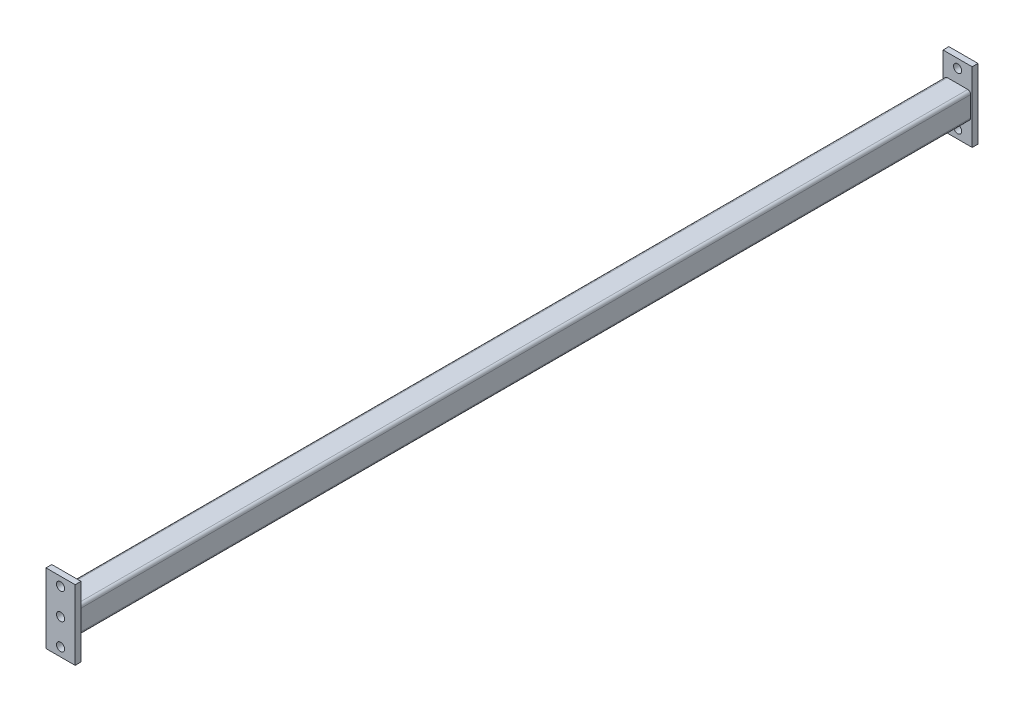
ISO-10303-21;
HEADER;
FILE_DESCRIPTION(('STEP AP214'),'2;1');
FILE_NAME('part.step','',(''),(''),'','','');
FILE_SCHEMA(('AUTOMOTIVE_DESIGN { 1 0 10303 214 1 1 1 1 }'));
ENDSEC;
DATA;
#1=APPLICATION_CONTEXT('core data for automotive mechanical design processes');
#2=APPLICATION_PROTOCOL_DEFINITION('international standard','automotive_design',2000,#1);
#3=PRODUCT_CONTEXT('',#1,'mechanical');
#4=PRODUCT('Part','Part','',(#3));
#5=PRODUCT_RELATED_PRODUCT_CATEGORY('part','',(#4));
#6=PRODUCT_DEFINITION_FORMATION('','',#4);
#7=PRODUCT_DEFINITION_CONTEXT('part definition',#1,'design');
#8=PRODUCT_DEFINITION('design','',#6,#7);
#9=PRODUCT_DEFINITION_SHAPE('','',#8);
#10=(LENGTH_UNIT() NAMED_UNIT(*) SI_UNIT(.MILLI.,.METRE.));
#11=(NAMED_UNIT(*) PLANE_ANGLE_UNIT() SI_UNIT($,.RADIAN.));
#12=(NAMED_UNIT(*) SI_UNIT($,.STERADIAN.) SOLID_ANGLE_UNIT());
#13=UNCERTAINTY_MEASURE_WITH_UNIT(LENGTH_MEASURE(1.E-05),#10,'distance_accuracy_value','');
#14=(GEOMETRIC_REPRESENTATION_CONTEXT(3) GLOBAL_UNCERTAINTY_ASSIGNED_CONTEXT((#13)) GLOBAL_UNIT_ASSIGNED_CONTEXT((#10,
#11,#12)) REPRESENTATION_CONTEXT('',''));
#15=CARTESIAN_POINT('',(0.,0.,0.));
#16=DIRECTION('',(0.,0.,1.));
#17=DIRECTION('',(1.,0.,0.));
#18=AXIS2_PLACEMENT_3D('',#15,#16,#17);
#19=CARTESIAN_POINT('',(-25.,-60.,10.));
#20=DIRECTION('',(0.,0.,1.));
#21=DIRECTION('',(1.,0.,0.));
#22=AXIS2_PLACEMENT_3D('',#19,#20,#21);
#23=PLANE('',#22);
#24=DIRECTION('',(0.,-1.,0.));
#25=VECTOR('',#24,1.);
#26=CARTESIAN_POINT('',(-25.,60.,10.));
#27=LINE('',#26,#25);
#28=CARTESIAN_POINT('',(-25.,60.,10.));
#29=VERTEX_POINT('',#28);
#30=CARTESIAN_POINT('',(-25.,-60.,10.));
#31=VERTEX_POINT('',#30);
#32=EDGE_CURVE('E334',#29,#31,#27,.T.);
#33=ORIENTED_EDGE('',*,*,#32,.T.);
#34=DIRECTION('',(1.,0.,0.));
#35=VECTOR('',#34,1.);
#36=CARTESIAN_POINT('',(-25.,-60.,10.));
#37=LINE('',#36,#35);
#38=CARTESIAN_POINT('',(25.,-60.,10.));
#39=VERTEX_POINT('',#38);
#40=EDGE_CURVE('E337',#31,#39,#37,.T.);
#41=ORIENTED_EDGE('',*,*,#40,.T.);
#42=DIRECTION('',(0.,1.,0.));
#43=VECTOR('',#42,1.);
#44=CARTESIAN_POINT('',(25.,60.,10.));
#45=LINE('',#44,#43);
#46=CARTESIAN_POINT('',(25.,60.,10.));
#47=VERTEX_POINT('',#46);
#48=EDGE_CURVE('E339',#39,#47,#45,.T.);
#49=ORIENTED_EDGE('',*,*,#48,.T.);
#50=DIRECTION('',(-1.,0.,0.));
#51=VECTOR('',#50,1.);
#52=CARTESIAN_POINT('',(-25.,60.,10.));
#53=LINE('',#52,#51);
#54=EDGE_CURVE('E341',#47,#29,#53,.T.);
#55=ORIENTED_EDGE('',*,*,#54,.T.);
#56=EDGE_LOOP('',(#33,#41,#49,#55));
#57=FACE_BOUND('',#56,.T.);
#58=CARTESIAN_POINT('',(0.,45.,10.));
#59=DIRECTION('',(0.,0.,1.));
#60=DIRECTION('',(1.,0.,0.));
#61=AXIS2_PLACEMENT_3D('',#58,#59,#60);
#62=CIRCLE('',#61,7.);
#63=CARTESIAN_POINT('',(7.,45.,10.));
#64=VERTEX_POINT('',#63);
#65=EDGE_CURVE('E322',#64,#64,#62,.T.);
#66=ORIENTED_EDGE('',*,*,#65,.F.);
#67=EDGE_LOOP('',(#66));
#68=FACE_BOUND('',#67,.T.);
#69=CARTESIAN_POINT('',(0.,-45.,10.));
#70=DIRECTION('',(0.,0.,1.));
#71=DIRECTION('',(1.,0.,0.));
#72=AXIS2_PLACEMENT_3D('',#69,#70,#71);
#73=CIRCLE('',#72,7.);
#74=CARTESIAN_POINT('',(7.,-45.,10.));
#75=VERTEX_POINT('',#74);
#76=EDGE_CURVE('E310',#75,#75,#73,.T.);
#77=ORIENTED_EDGE('',*,*,#76,.F.);
#78=EDGE_LOOP('',(#77));
#79=FACE_BOUND('',#78,.T.);
#80=DIRECTION('',(0.,-1.,0.));
#81=VECTOR('',#80,1.);
#82=CARTESIAN_POINT('',(-22.5,17.5,10.));
#83=LINE('',#82,#81);
#84=CARTESIAN_POINT('',(-22.5,17.5,10.));
#85=VERTEX_POINT('',#84);
#86=CARTESIAN_POINT('',(-22.5,-17.5,10.));
#87=VERTEX_POINT('',#86);
#88=EDGE_CURVE('E248',#85,#87,#83,.T.);
#89=ORIENTED_EDGE('',*,*,#88,.F.);
#90=CARTESIAN_POINT('',(-17.5,17.5,10.));
#91=DIRECTION('',(0.,0.,1.));
#92=DIRECTION('',(-1.,0.,0.));
#93=AXIS2_PLACEMENT_3D('',#90,#91,#92);
#94=CIRCLE('',#93,5.);
#95=CARTESIAN_POINT('',(-17.5,22.5,10.));
#96=VERTEX_POINT('',#95);
#97=EDGE_CURVE('E245',#96,#85,#94,.T.);
#98=ORIENTED_EDGE('',*,*,#97,.F.);
#99=DIRECTION('',(-1.,0.,0.));
#100=VECTOR('',#99,1.);
#101=CARTESIAN_POINT('',(-17.5,22.5,10.));
#102=LINE('',#101,#100);
#103=CARTESIAN_POINT('',(17.5,22.5,10.));
#104=VERTEX_POINT('',#103);
#105=EDGE_CURVE('E260',#104,#96,#102,.T.);
#106=ORIENTED_EDGE('',*,*,#105,.F.);
#107=CARTESIAN_POINT('',(17.5,17.5,10.));
#108=DIRECTION('',(0.,0.,1.));
#109=DIRECTION('',(-1.,0.,0.));
#110=AXIS2_PLACEMENT_3D('',#107,#108,#109);
#111=CIRCLE('',#110,5.);
#112=CARTESIAN_POINT('',(22.5,17.5,10.));
#113=VERTEX_POINT('',#112);
#114=EDGE_CURVE('E258',#113,#104,#111,.T.);
#115=ORIENTED_EDGE('',*,*,#114,.F.);
#116=DIRECTION('',(0.,1.,0.));
#117=VECTOR('',#116,1.);
#118=CARTESIAN_POINT('',(22.5,17.5,10.));
#119=LINE('',#118,#117);
#120=CARTESIAN_POINT('',(22.5,-17.5,10.));
#121=VERTEX_POINT('',#120);
#122=EDGE_CURVE('E256',#121,#113,#119,.T.);
#123=ORIENTED_EDGE('',*,*,#122,.F.);
#124=CARTESIAN_POINT('',(17.5,-17.5,10.));
#125=DIRECTION('',(0.,0.,1.));
#126=DIRECTION('',(-1.,0.,0.));
#127=AXIS2_PLACEMENT_3D('',#124,#125,#126);
#128=CIRCLE('',#127,5.);
#129=CARTESIAN_POINT('',(17.5,-22.5,10.));
#130=VERTEX_POINT('',#129);
#131=EDGE_CURVE('E254',#130,#121,#128,.T.);
#132=ORIENTED_EDGE('',*,*,#131,.F.);
#133=DIRECTION('',(1.,0.,0.));
#134=VECTOR('',#133,1.);
#135=CARTESIAN_POINT('',(-17.5,-22.5,10.));
#136=LINE('',#135,#134);
#137=CARTESIAN_POINT('',(-17.5,-22.5,10.));
#138=VERTEX_POINT('',#137);
#139=EDGE_CURVE('E252',#138,#130,#136,.T.);
#140=ORIENTED_EDGE('',*,*,#139,.F.);
#141=CARTESIAN_POINT('',(-17.5,-17.5,10.));
#142=DIRECTION('',(0.,0.,1.));
#143=DIRECTION('',(-1.,0.,0.));
#144=AXIS2_PLACEMENT_3D('',#141,#142,#143);
#145=CIRCLE('',#144,5.);
#146=EDGE_CURVE('E250',#87,#138,#145,.T.);
#147=ORIENTED_EDGE('',*,*,#146,.F.);
#148=EDGE_LOOP('',(#89,#98,#106,#115,#123,#132,#140,#147));
#149=FACE_BOUND('',#148,.T.);
#150=ADVANCED_FACE('F30',(#57,#68,#79,#149),#23,.T.);
#151=DIRECTION('',(0.,-1.,0.));
#152=VECTOR('',#151,1.);
#153=CARTESIAN_POINT('',(-19.5,19.5,10.));
#154=LINE('',#153,#152);
#155=CARTESIAN_POINT('',(-19.5,19.5,10.));
#156=VERTEX_POINT('',#155);
#157=CARTESIAN_POINT('',(-19.5,-19.5,10.));
#158=VERTEX_POINT('',#157);
#159=EDGE_CURVE('E53',#156,#158,#154,.T.);
#160=ORIENTED_EDGE('',*,*,#159,.T.);
#161=DIRECTION('',(1.,0.,0.));
#162=VECTOR('',#161,1.);
#163=CARTESIAN_POINT('',(-19.5,-19.5,10.));
#164=LINE('',#163,#162);
#165=CARTESIAN_POINT('',(19.5,-19.5,10.));
#166=VERTEX_POINT('',#165);
#167=EDGE_CURVE('E215',#158,#166,#164,.T.);
#168=ORIENTED_EDGE('',*,*,#167,.T.);
#169=DIRECTION('',(0.,1.,0.));
#170=VECTOR('',#169,1.);
#171=CARTESIAN_POINT('',(19.5,19.5,10.));
#172=LINE('',#171,#170);
#173=CARTESIAN_POINT('',(19.5,19.5,10.));
#174=VERTEX_POINT('',#173);
#175=EDGE_CURVE('E217',#166,#174,#172,.T.);
#176=ORIENTED_EDGE('',*,*,#175,.T.);
#177=DIRECTION('',(-1.,0.,0.));
#178=VECTOR('',#177,1.);
#179=CARTESIAN_POINT('',(-19.5,19.5,10.));
#180=LINE('',#179,#178);
#181=EDGE_CURVE('E219',#174,#156,#180,.T.);
#182=ORIENTED_EDGE('',*,*,#181,.T.);
#183=EDGE_LOOP('',(#160,#168,#176,#182));
#184=FACE_BOUND('',#183,.T.);
#185=CARTESIAN_POINT('',(0.,0.,10.));
#186=DIRECTION('',(0.,0.,1.));
#187=DIRECTION('',(1.,0.,0.));
#188=AXIS2_PLACEMENT_3D('',#185,#186,#187);
#189=CIRCLE('',#188,7.);
#190=CARTESIAN_POINT('',(7.,0.,10.));
#191=VERTEX_POINT('',#190);
#192=EDGE_CURVE('E316',#191,#191,#189,.T.);
#193=ORIENTED_EDGE('',*,*,#192,.F.);
#194=EDGE_LOOP('',(#193));
#195=FACE_BOUND('',#194,.T.);
#196=ADVANCED_FACE('F378',(#184,#195),#23,.T.);
#197=CARTESIAN_POINT('',(-25.,-60.,0.));
#198=DIRECTION('',(0.,0.,1.));
#199=DIRECTION('',(1.,0.,0.));
#200=AXIS2_PLACEMENT_3D('',#197,#198,#199);
#201=PLANE('',#200);
#202=CARTESIAN_POINT('',(0.,0.,0.));
#203=DIRECTION('',(0.,0.,1.));
#204=DIRECTION('',(1.,0.,0.));
#205=AXIS2_PLACEMENT_3D('',#202,#203,#204);
#206=CIRCLE('',#205,7.);
#207=CARTESIAN_POINT('',(7.,0.,0.));
#208=VERTEX_POINT('',#207);
#209=EDGE_CURVE('E313',#208,#208,#206,.T.);
#210=ORIENTED_EDGE('',*,*,#209,.T.);
#211=EDGE_LOOP('',(#210));
#212=FACE_BOUND('',#211,.T.);
#213=DIRECTION('',(0.,-1.,0.));
#214=VECTOR('',#213,1.);
#215=CARTESIAN_POINT('',(-25.,60.,0.));
#216=LINE('',#215,#214);
#217=CARTESIAN_POINT('',(-25.,60.,0.));
#218=VERTEX_POINT('',#217);
#219=CARTESIAN_POINT('',(-25.,-60.,0.));
#220=VERTEX_POINT('',#219);
#221=EDGE_CURVE('E325',#218,#220,#216,.T.);
#222=ORIENTED_EDGE('',*,*,#221,.F.);
#223=DIRECTION('',(-1.,0.,0.));
#224=VECTOR('',#223,1.);
#225=CARTESIAN_POINT('',(-25.,60.,0.));
#226=LINE('',#225,#224);
#227=CARTESIAN_POINT('',(25.,60.,0.));
#228=VERTEX_POINT('',#227);
#229=EDGE_CURVE('E332',#228,#218,#226,.T.);
#230=ORIENTED_EDGE('',*,*,#229,.F.);
#231=DIRECTION('',(0.,1.,0.));
#232=VECTOR('',#231,1.);
#233=CARTESIAN_POINT('',(25.,60.,0.));
#234=LINE('',#233,#232);
#235=CARTESIAN_POINT('',(25.,-60.,0.));
#236=VERTEX_POINT('',#235);
#237=EDGE_CURVE('E330',#236,#228,#234,.T.);
#238=ORIENTED_EDGE('',*,*,#237,.F.);
#239=DIRECTION('',(1.,0.,0.));
#240=VECTOR('',#239,1.);
#241=CARTESIAN_POINT('',(-25.,-60.,0.));
#242=LINE('',#241,#240);
#243=EDGE_CURVE('E328',#220,#236,#242,.T.);
#244=ORIENTED_EDGE('',*,*,#243,.F.);
#245=EDGE_LOOP('',(#222,#230,#238,#244));
#246=FACE_BOUND('',#245,.T.);
#247=CARTESIAN_POINT('',(0.,45.,0.));
#248=DIRECTION('',(0.,0.,1.));
#249=DIRECTION('',(1.,0.,0.));
#250=AXIS2_PLACEMENT_3D('',#247,#248,#249);
#251=CIRCLE('',#250,7.);
#252=CARTESIAN_POINT('',(7.,45.,0.));
#253=VERTEX_POINT('',#252);
#254=EDGE_CURVE('E319',#253,#253,#251,.T.);
#255=ORIENTED_EDGE('',*,*,#254,.T.);
#256=EDGE_LOOP('',(#255));
#257=FACE_BOUND('',#256,.T.);
#258=CARTESIAN_POINT('',(0.,-45.,0.));
#259=DIRECTION('',(0.,0.,1.));
#260=DIRECTION('',(1.,0.,0.));
#261=AXIS2_PLACEMENT_3D('',#258,#259,#260);
#262=CIRCLE('',#261,7.);
#263=CARTESIAN_POINT('',(7.,-45.,0.));
#264=VERTEX_POINT('',#263);
#265=EDGE_CURVE('E307',#264,#264,#262,.T.);
#266=ORIENTED_EDGE('',*,*,#265,.T.);
#267=EDGE_LOOP('',(#266));
#268=FACE_BOUND('',#267,.T.);
#269=ADVANCED_FACE('F359',(#212,#246,#257,#268),#201,.F.);
#270=CARTESIAN_POINT('',(-25.,60.,10.));
#271=DIRECTION('',(1.,0.,0.));
#272=DIRECTION('',(0.,1.,0.));
#273=AXIS2_PLACEMENT_3D('',#270,#271,#272);
#274=PLANE('',#273);
#275=ORIENTED_EDGE('',*,*,#221,.T.);
#276=DIRECTION('',(0.,0.,-1.));
#277=VECTOR('',#276,1.);
#278=CARTESIAN_POINT('',(-25.,-60.,10.));
#279=LINE('',#278,#277);
#280=EDGE_CURVE('E11',#31,#220,#279,.T.);
#281=ORIENTED_EDGE('',*,*,#280,.F.);
#282=ORIENTED_EDGE('',*,*,#32,.F.);
#283=DIRECTION('',(0.,0.,-1.));
#284=VECTOR('',#283,1.);
#285=CARTESIAN_POINT('',(-25.,60.,10.));
#286=LINE('',#285,#284);
#287=EDGE_CURVE('E343',#29,#218,#286,.T.);
#288=ORIENTED_EDGE('',*,*,#287,.T.);
#289=EDGE_LOOP('',(#275,#281,#282,#288));
#290=FACE_BOUND('',#289,.T.);
#291=ADVANCED_FACE('F32',(#290),#274,.F.);
#292=CARTESIAN_POINT('',(-25.,-60.,10.));
#293=DIRECTION('',(0.,1.,0.));
#294=DIRECTION('',(0.,0.,1.));
#295=AXIS2_PLACEMENT_3D('',#292,#293,#294);
#296=PLANE('',#295);
#297=ORIENTED_EDGE('',*,*,#243,.T.);
#298=DIRECTION('',(0.,0.,-1.));
#299=VECTOR('',#298,1.);
#300=CARTESIAN_POINT('',(25.,-60.,10.));
#301=LINE('',#300,#299);
#302=EDGE_CURVE('E38',#39,#236,#301,.T.);
#303=ORIENTED_EDGE('',*,*,#302,.F.);
#304=ORIENTED_EDGE('',*,*,#40,.F.);
#305=ORIENTED_EDGE('',*,*,#280,.T.);
#306=EDGE_LOOP('',(#297,#303,#304,#305));
#307=FACE_BOUND('',#306,.T.);
#308=ADVANCED_FACE('F370',(#307),#296,.F.);
#309=CARTESIAN_POINT('',(25.,60.,10.));
#310=DIRECTION('',(-1.,0.,0.));
#311=DIRECTION('',(0.,-1.,0.));
#312=AXIS2_PLACEMENT_3D('',#309,#310,#311);
#313=PLANE('',#312);
#314=ORIENTED_EDGE('',*,*,#237,.T.);
#315=DIRECTION('',(0.,0.,-1.));
#316=VECTOR('',#315,1.);
#317=CARTESIAN_POINT('',(25.,60.,10.));
#318=LINE('',#317,#316);
#319=EDGE_CURVE('E346',#47,#228,#318,.T.);
#320=ORIENTED_EDGE('',*,*,#319,.F.);
#321=ORIENTED_EDGE('',*,*,#48,.F.);
#322=ORIENTED_EDGE('',*,*,#302,.T.);
#323=EDGE_LOOP('',(#314,#320,#321,#322));
#324=FACE_BOUND('',#323,.T.);
#325=ADVANCED_FACE('F353',(#324),#313,.F.);
#326=CARTESIAN_POINT('',(-25.,60.,10.));
#327=DIRECTION('',(0.,-1.,0.));
#328=DIRECTION('',(0.,0.,-1.));
#329=AXIS2_PLACEMENT_3D('',#326,#327,#328);
#330=PLANE('',#329);
#331=ORIENTED_EDGE('',*,*,#229,.T.);
#332=ORIENTED_EDGE('',*,*,#287,.F.);
#333=ORIENTED_EDGE('',*,*,#54,.F.);
#334=ORIENTED_EDGE('',*,*,#319,.T.);
#335=EDGE_LOOP('',(#331,#332,#333,#334));
#336=FACE_BOUND('',#335,.T.);
#337=ADVANCED_FACE('F363',(#336),#330,.F.);
#338=CARTESIAN_POINT('',(0.,45.,10.));
#339=DIRECTION('',(0.,0.,-1.));
#340=DIRECTION('',(-1.,0.,0.));
#341=AXIS2_PLACEMENT_3D('',#338,#339,#340);
#342=CYLINDRICAL_SURFACE('',#341,7.);
#343=ORIENTED_EDGE('',*,*,#65,.T.);
#344=EDGE_LOOP('',(#343));
#345=FACE_BOUND('',#344,.T.);
#346=ORIENTED_EDGE('',*,*,#254,.F.);
#347=EDGE_LOOP('',(#346));
#348=FACE_BOUND('',#347,.T.);
#349=ADVANCED_FACE('F387',(#345,#348),#342,.F.);
#350=CARTESIAN_POINT('',(0.,0.,10.));
#351=DIRECTION('',(0.,0.,-1.));
#352=DIRECTION('',(-1.,0.,0.));
#353=AXIS2_PLACEMENT_3D('',#350,#351,#352);
#354=CYLINDRICAL_SURFACE('',#353,7.);
#355=ORIENTED_EDGE('',*,*,#192,.T.);
#356=EDGE_LOOP('',(#355));
#357=FACE_BOUND('',#356,.T.);
#358=ORIENTED_EDGE('',*,*,#209,.F.);
#359=EDGE_LOOP('',(#358));
#360=FACE_BOUND('',#359,.T.);
#361=ADVANCED_FACE('F391',(#357,#360),#354,.F.);
#362=CARTESIAN_POINT('',(0.,-45.,10.));
#363=DIRECTION('',(0.,0.,-1.));
#364=DIRECTION('',(-1.,0.,0.));
#365=AXIS2_PLACEMENT_3D('',#362,#363,#364);
#366=CYLINDRICAL_SURFACE('',#365,7.);
#367=ORIENTED_EDGE('',*,*,#76,.T.);
#368=EDGE_LOOP('',(#367));
#369=FACE_BOUND('',#368,.T.);
#370=ORIENTED_EDGE('',*,*,#265,.F.);
#371=EDGE_LOOP('',(#370));
#372=FACE_BOUND('',#371,.T.);
#373=ADVANCED_FACE('F396',(#369,#372),#366,.F.);
#374=CARTESIAN_POINT('',(-17.5,17.5,1540.));
#375=DIRECTION('',(0.,0.,-1.));
#376=DIRECTION('',(-1.,0.,0.));
#377=AXIS2_PLACEMENT_3D('',#374,#375,#376);
#378=CYLINDRICAL_SURFACE('',#377,5.);
#379=ORIENTED_EDGE('',*,*,#97,.T.);
#380=DIRECTION('',(0.,0.,-1.));
#381=VECTOR('',#380,1.);
#382=CARTESIAN_POINT('',(-22.5,17.5,1540.));
#383=LINE('',#382,#381);
#384=CARTESIAN_POINT('',(-22.5,17.5,1540.));
#385=VERTEX_POINT('',#384);
#386=EDGE_CURVE('E305',#385,#85,#383,.T.);
#387=ORIENTED_EDGE('',*,*,#386,.F.);
#388=CARTESIAN_POINT('',(-17.5,17.5,1540.));
#389=DIRECTION('',(0.,0.,1.));
#390=DIRECTION('',(-1.,0.,0.));
#391=AXIS2_PLACEMENT_3D('',#388,#389,#390);
#392=CIRCLE('',#391,5.);
#393=CARTESIAN_POINT('',(-17.5,22.5,1540.));
#394=VERTEX_POINT('',#393);
#395=EDGE_CURVE('E262',#394,#385,#392,.T.);
#396=ORIENTED_EDGE('',*,*,#395,.F.);
#397=DIRECTION('',(0.,0.,-1.));
#398=VECTOR('',#397,1.);
#399=CARTESIAN_POINT('',(-17.5,22.5,1540.));
#400=LINE('',#399,#398);
#401=EDGE_CURVE('E286',#394,#96,#400,.T.);
#402=ORIENTED_EDGE('',*,*,#401,.T.);
#403=EDGE_LOOP('',(#379,#387,#396,#402));
#404=FACE_BOUND('',#403,.T.);
#405=ADVANCED_FACE('F403',(#404),#378,.T.);
#406=CARTESIAN_POINT('',(-22.5,17.5,1540.));
#407=DIRECTION('',(1.,0.,0.));
#408=DIRECTION('',(0.,1.,0.));
#409=AXIS2_PLACEMENT_3D('',#406,#407,#408);
#410=PLANE('',#409);
#411=ORIENTED_EDGE('',*,*,#88,.T.);
#412=DIRECTION('',(0.,0.,-1.));
#413=VECTOR('',#412,1.);
#414=CARTESIAN_POINT('',(-22.5,-17.5,1540.));
#415=LINE('',#414,#413);
#416=CARTESIAN_POINT('',(-22.5,-17.5,1540.));
#417=VERTEX_POINT('',#416);
#418=EDGE_CURVE('E302',#417,#87,#415,.T.);
#419=ORIENTED_EDGE('',*,*,#418,.F.);
#420=DIRECTION('',(0.,-1.,0.));
#421=VECTOR('',#420,1.);
#422=CARTESIAN_POINT('',(-22.5,17.5,1540.));
#423=LINE('',#422,#421);
#424=EDGE_CURVE('E265',#385,#417,#423,.T.);
#425=ORIENTED_EDGE('',*,*,#424,.F.);
#426=ORIENTED_EDGE('',*,*,#386,.T.);
#427=EDGE_LOOP('',(#411,#419,#425,#426));
#428=FACE_BOUND('',#427,.T.);
#429=ADVANCED_FACE('F407',(#428),#410,.F.);
#430=CARTESIAN_POINT('',(-17.5,-17.5,1540.));
#431=DIRECTION('',(0.,0.,-1.));
#432=DIRECTION('',(-1.,0.,0.));
#433=AXIS2_PLACEMENT_3D('',#430,#431,#432);
#434=CYLINDRICAL_SURFACE('',#433,5.);
#435=ORIENTED_EDGE('',*,*,#146,.T.);
#436=DIRECTION('',(0.,0.,-1.));
#437=VECTOR('',#436,1.);
#438=CARTESIAN_POINT('',(-17.5,-22.5,1540.));
#439=LINE('',#438,#437);
#440=CARTESIAN_POINT('',(-17.5,-22.5,1540.));
#441=VERTEX_POINT('',#440);
#442=EDGE_CURVE('E299',#441,#138,#439,.T.);
#443=ORIENTED_EDGE('',*,*,#442,.F.);
#444=CARTESIAN_POINT('',(-17.5,-17.5,1540.));
#445=DIRECTION('',(0.,0.,1.));
#446=DIRECTION('',(-1.,0.,0.));
#447=AXIS2_PLACEMENT_3D('',#444,#445,#446);
#448=CIRCLE('',#447,5.);
#449=EDGE_CURVE('E268',#417,#441,#448,.T.);
#450=ORIENTED_EDGE('',*,*,#449,.F.);
#451=ORIENTED_EDGE('',*,*,#418,.T.);
#452=EDGE_LOOP('',(#435,#443,#450,#451));
#453=FACE_BOUND('',#452,.T.);
#454=ADVANCED_FACE('F411',(#453),#434,.T.);
#455=CARTESIAN_POINT('',(-17.5,-22.5,1540.));
#456=DIRECTION('',(0.,1.,0.));
#457=DIRECTION('',(0.,0.,1.));
#458=AXIS2_PLACEMENT_3D('',#455,#456,#457);
#459=PLANE('',#458);
#460=ORIENTED_EDGE('',*,*,#139,.T.);
#461=DIRECTION('',(0.,0.,-1.));
#462=VECTOR('',#461,1.);
#463=CARTESIAN_POINT('',(17.5,-22.5,1540.));
#464=LINE('',#463,#462);
#465=CARTESIAN_POINT('',(17.5,-22.5,1540.));
#466=VERTEX_POINT('',#465);
#467=EDGE_CURVE('E296',#466,#130,#464,.T.);
#468=ORIENTED_EDGE('',*,*,#467,.F.);
#469=DIRECTION('',(1.,0.,0.));
#470=VECTOR('',#469,1.);
#471=CARTESIAN_POINT('',(-17.5,-22.5,1540.));
#472=LINE('',#471,#470);
#473=EDGE_CURVE('E271',#441,#466,#472,.T.);
#474=ORIENTED_EDGE('',*,*,#473,.F.);
#475=ORIENTED_EDGE('',*,*,#442,.T.);
#476=EDGE_LOOP('',(#460,#468,#474,#475));
#477=FACE_BOUND('',#476,.T.);
#478=ADVANCED_FACE('F415',(#477),#459,.F.);
#479=CARTESIAN_POINT('',(17.5,-17.5,1540.));
#480=DIRECTION('',(0.,0.,-1.));
#481=DIRECTION('',(-1.,0.,0.));
#482=AXIS2_PLACEMENT_3D('',#479,#480,#481);
#483=CYLINDRICAL_SURFACE('',#482,5.);
#484=ORIENTED_EDGE('',*,*,#131,.T.);
#485=DIRECTION('',(0.,0.,-1.));
#486=VECTOR('',#485,1.);
#487=CARTESIAN_POINT('',(22.5,-17.5,1540.));
#488=LINE('',#487,#486);
#489=CARTESIAN_POINT('',(22.5,-17.5,1540.));
#490=VERTEX_POINT('',#489);
#491=EDGE_CURVE('E293',#490,#121,#488,.T.);
#492=ORIENTED_EDGE('',*,*,#491,.F.);
#493=CARTESIAN_POINT('',(17.5,-17.5,1540.));
#494=DIRECTION('',(0.,0.,1.));
#495=DIRECTION('',(-1.,0.,0.));
#496=AXIS2_PLACEMENT_3D('',#493,#494,#495);
#497=CIRCLE('',#496,5.);
#498=EDGE_CURVE('E274',#466,#490,#497,.T.);
#499=ORIENTED_EDGE('',*,*,#498,.F.);
#500=ORIENTED_EDGE('',*,*,#467,.T.);
#501=EDGE_LOOP('',(#484,#492,#499,#500));
#502=FACE_BOUND('',#501,.T.);
#503=ADVANCED_FACE('F419',(#502),#483,.T.);
#504=CARTESIAN_POINT('',(22.5,17.5,1540.));
#505=DIRECTION('',(-1.,0.,0.));
#506=DIRECTION('',(0.,-1.,0.));
#507=AXIS2_PLACEMENT_3D('',#504,#505,#506);
#508=PLANE('',#507);
#509=ORIENTED_EDGE('',*,*,#122,.T.);
#510=DIRECTION('',(0.,0.,-1.));
#511=VECTOR('',#510,1.);
#512=CARTESIAN_POINT('',(22.5,17.5,1540.));
#513=LINE('',#512,#511);
#514=CARTESIAN_POINT('',(22.5,17.5,1540.));
#515=VERTEX_POINT('',#514);
#516=EDGE_CURVE('E290',#515,#113,#513,.T.);
#517=ORIENTED_EDGE('',*,*,#516,.F.);
#518=DIRECTION('',(0.,1.,0.));
#519=VECTOR('',#518,1.);
#520=CARTESIAN_POINT('',(22.5,17.5,1540.));
#521=LINE('',#520,#519);
#522=EDGE_CURVE('E277',#490,#515,#521,.T.);
#523=ORIENTED_EDGE('',*,*,#522,.F.);
#524=ORIENTED_EDGE('',*,*,#491,.T.);
#525=EDGE_LOOP('',(#509,#517,#523,#524));
#526=FACE_BOUND('',#525,.T.);
#527=ADVANCED_FACE('F423',(#526),#508,.F.);
#528=CARTESIAN_POINT('',(17.5,17.5,1540.));
#529=DIRECTION('',(0.,0.,-1.));
#530=DIRECTION('',(-1.,0.,0.));
#531=AXIS2_PLACEMENT_3D('',#528,#529,#530);
#532=CYLINDRICAL_SURFACE('',#531,5.);
#533=ORIENTED_EDGE('',*,*,#114,.T.);
#534=DIRECTION('',(0.,0.,-1.));
#535=VECTOR('',#534,1.);
#536=CARTESIAN_POINT('',(17.5,22.5,1540.));
#537=LINE('',#536,#535);
#538=CARTESIAN_POINT('',(17.5,22.5,1540.));
#539=VERTEX_POINT('',#538);
#540=EDGE_CURVE('E45',#539,#104,#537,.T.);
#541=ORIENTED_EDGE('',*,*,#540,.F.);
#542=CARTESIAN_POINT('',(17.5,17.5,1540.));
#543=DIRECTION('',(0.,0.,1.));
#544=DIRECTION('',(-1.,0.,0.));
#545=AXIS2_PLACEMENT_3D('',#542,#543,#544);
#546=CIRCLE('',#545,5.);
#547=EDGE_CURVE('E280',#515,#539,#546,.T.);
#548=ORIENTED_EDGE('',*,*,#547,.F.);
#549=ORIENTED_EDGE('',*,*,#516,.T.);
#550=EDGE_LOOP('',(#533,#541,#548,#549));
#551=FACE_BOUND('',#550,.T.);
#552=ADVANCED_FACE('F427',(#551),#532,.T.);
#553=CARTESIAN_POINT('',(-17.5,22.5,1540.));
#554=DIRECTION('',(0.,-1.,0.));
#555=DIRECTION('',(0.,0.,-1.));
#556=AXIS2_PLACEMENT_3D('',#553,#554,#555);
#557=PLANE('',#556);
#558=ORIENTED_EDGE('',*,*,#105,.T.);
#559=ORIENTED_EDGE('',*,*,#401,.F.);
#560=DIRECTION('',(-1.,0.,0.));
#561=VECTOR('',#560,1.);
#562=CARTESIAN_POINT('',(-17.5,22.5,1540.));
#563=LINE('',#562,#561);
#564=EDGE_CURVE('E283',#539,#394,#563,.T.);
#565=ORIENTED_EDGE('',*,*,#564,.F.);
#566=ORIENTED_EDGE('',*,*,#540,.T.);
#567=EDGE_LOOP('',(#558,#559,#565,#566));
#568=FACE_BOUND('',#567,.T.);
#569=ADVANCED_FACE('F431',(#568),#557,.F.);
#570=CARTESIAN_POINT('',(-19.5,19.5,1540.));
#571=DIRECTION('',(1.,0.,0.));
#572=DIRECTION('',(0.,1.,0.));
#573=AXIS2_PLACEMENT_3D('',#570,#571,#572);
#574=PLANE('',#573);
#575=ORIENTED_EDGE('',*,*,#159,.F.);
#576=DIRECTION('',(0.,0.,-1.));
#577=VECTOR('',#576,1.);
#578=CARTESIAN_POINT('',(-19.5,19.5,1540.));
#579=LINE('',#578,#577);
#580=CARTESIAN_POINT('',(-19.5,19.5,1540.));
#581=VERTEX_POINT('',#580);
#582=EDGE_CURVE('E233',#581,#156,#579,.T.);
#583=ORIENTED_EDGE('',*,*,#582,.F.);
#584=DIRECTION('',(0.,-1.,0.));
#585=VECTOR('',#584,1.);
#586=CARTESIAN_POINT('',(-19.5,19.5,1540.));
#587=LINE('',#586,#585);
#588=CARTESIAN_POINT('',(-19.5,-19.5,1540.));
#589=VERTEX_POINT('',#588);
#590=EDGE_CURVE('E221',#581,#589,#587,.T.);
#591=ORIENTED_EDGE('',*,*,#590,.T.);
#592=DIRECTION('',(0.,0.,-1.));
#593=VECTOR('',#592,1.);
#594=CARTESIAN_POINT('',(-19.5,-19.5,1540.));
#595=LINE('',#594,#593);
#596=EDGE_CURVE('E242',#589,#158,#595,.T.);
#597=ORIENTED_EDGE('',*,*,#596,.T.);
#598=EDGE_LOOP('',(#575,#583,#591,#597));
#599=FACE_BOUND('',#598,.T.);
#600=ADVANCED_FACE('F435',(#599),#574,.T.);
#601=CARTESIAN_POINT('',(-19.5,-19.5,1540.));
#602=DIRECTION('',(0.,1.,0.));
#603=DIRECTION('',(0.,0.,1.));
#604=AXIS2_PLACEMENT_3D('',#601,#602,#603);
#605=PLANE('',#604);
#606=ORIENTED_EDGE('',*,*,#167,.F.);
#607=ORIENTED_EDGE('',*,*,#596,.F.);
#608=DIRECTION('',(1.,0.,0.));
#609=VECTOR('',#608,1.);
#610=CARTESIAN_POINT('',(-19.5,-19.5,1540.));
#611=LINE('',#610,#609);
#612=CARTESIAN_POINT('',(19.5,-19.5,1540.));
#613=VERTEX_POINT('',#612);
#614=EDGE_CURVE('E224',#589,#613,#611,.T.);
#615=ORIENTED_EDGE('',*,*,#614,.T.);
#616=DIRECTION('',(0.,0.,-1.));
#617=VECTOR('',#616,1.);
#618=CARTESIAN_POINT('',(19.5,-19.5,1540.));
#619=LINE('',#618,#617);
#620=EDGE_CURVE('E239',#613,#166,#619,.T.);
#621=ORIENTED_EDGE('',*,*,#620,.T.);
#622=EDGE_LOOP('',(#606,#607,#615,#621));
#623=FACE_BOUND('',#622,.T.);
#624=ADVANCED_FACE('F438',(#623),#605,.T.);
#625=CARTESIAN_POINT('',(19.5,19.5,1540.));
#626=DIRECTION('',(-1.,0.,0.));
#627=DIRECTION('',(0.,-1.,0.));
#628=AXIS2_PLACEMENT_3D('',#625,#626,#627);
#629=PLANE('',#628);
#630=ORIENTED_EDGE('',*,*,#175,.F.);
#631=ORIENTED_EDGE('',*,*,#620,.F.);
#632=DIRECTION('',(0.,1.,0.));
#633=VECTOR('',#632,1.);
#634=CARTESIAN_POINT('',(19.5,19.5,1540.));
#635=LINE('',#634,#633);
#636=CARTESIAN_POINT('',(19.5,19.5,1540.));
#637=VERTEX_POINT('',#636);
#638=EDGE_CURVE('E227',#613,#637,#635,.T.);
#639=ORIENTED_EDGE('',*,*,#638,.T.);
#640=DIRECTION('',(0.,0.,-1.));
#641=VECTOR('',#640,1.);
#642=CARTESIAN_POINT('',(19.5,19.5,1540.));
#643=LINE('',#642,#641);
#644=EDGE_CURVE('E236',#637,#174,#643,.T.);
#645=ORIENTED_EDGE('',*,*,#644,.T.);
#646=EDGE_LOOP('',(#630,#631,#639,#645));
#647=FACE_BOUND('',#646,.T.);
#648=ADVANCED_FACE('F442',(#647),#629,.T.);
#649=CARTESIAN_POINT('',(-19.5,19.5,1540.));
#650=DIRECTION('',(0.,-1.,0.));
#651=DIRECTION('',(0.,0.,-1.));
#652=AXIS2_PLACEMENT_3D('',#649,#650,#651);
#653=PLANE('',#652);
#654=ORIENTED_EDGE('',*,*,#181,.F.);
#655=ORIENTED_EDGE('',*,*,#644,.F.);
#656=DIRECTION('',(-1.,0.,0.));
#657=VECTOR('',#656,1.);
#658=CARTESIAN_POINT('',(-19.5,19.5,1540.));
#659=LINE('',#658,#657);
#660=EDGE_CURVE('E230',#637,#581,#659,.T.);
#661=ORIENTED_EDGE('',*,*,#660,.T.);
#662=ORIENTED_EDGE('',*,*,#582,.T.);
#663=EDGE_LOOP('',(#654,#655,#661,#662));
#664=FACE_BOUND('',#663,.T.);
#665=ADVANCED_FACE('F446',(#664),#653,.T.);
#666=CARTESIAN_POINT('',(-25.,-60.,1540.));
#667=DIRECTION('',(0.,0.,1.));
#668=DIRECTION('',(1.,0.,0.));
#669=AXIS2_PLACEMENT_3D('',#666,#667,#668);
#670=PLANE('',#669);
#671=CARTESIAN_POINT('',(0.,45.,1540.));
#672=DIRECTION('',(0.,0.,1.));
#673=DIRECTION('',(1.,0.,0.));
#674=AXIS2_PLACEMENT_3D('',#671,#672,#673);
#675=CIRCLE('',#674,7.);
#676=CARTESIAN_POINT('',(6.99999999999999,45.,1540.));
#677=VERTEX_POINT('',#676);
#678=EDGE_CURVE('E492',#677,#677,#675,.T.);
#679=ORIENTED_EDGE('',*,*,#678,.T.);
#680=EDGE_LOOP('',(#679));
#681=FACE_BOUND('',#680,.T.);
#682=DIRECTION('',(0.,-1.,0.));
#683=VECTOR('',#682,1.);
#684=CARTESIAN_POINT('',(-25.,60.,1540.));
#685=LINE('',#684,#683);
#686=CARTESIAN_POINT('',(-25.,60.,1540.));
#687=VERTEX_POINT('',#686);
#688=CARTESIAN_POINT('',(-25.,-60.,1540.));
#689=VERTEX_POINT('',#688);
#690=EDGE_CURVE('E173',#687,#689,#685,.T.);
#691=ORIENTED_EDGE('',*,*,#690,.F.);
#692=DIRECTION('',(-1.,0.,0.));
#693=VECTOR('',#692,1.);
#694=CARTESIAN_POINT('',(-25.,60.,1540.));
#695=LINE('',#694,#693);
#696=CARTESIAN_POINT('',(25.,60.,1540.));
#697=VERTEX_POINT('',#696);
#698=EDGE_CURVE('E200',#697,#687,#695,.T.);
#699=ORIENTED_EDGE('',*,*,#698,.F.);
#700=DIRECTION('',(0.,1.,0.));
#701=VECTOR('',#700,1.);
#702=CARTESIAN_POINT('',(25.,60.,1540.));
#703=LINE('',#702,#701);
#704=CARTESIAN_POINT('',(25.,-60.,1540.));
#705=VERTEX_POINT('',#704);
#706=EDGE_CURVE('E174',#705,#697,#703,.T.);
#707=ORIENTED_EDGE('',*,*,#706,.F.);
#708=DIRECTION('',(1.,0.,0.));
#709=VECTOR('',#708,1.);
#710=CARTESIAN_POINT('',(-25.,-60.,1540.));
#711=LINE('',#710,#709);
#712=EDGE_CURVE('E167',#689,#705,#711,.T.);
#713=ORIENTED_EDGE('',*,*,#712,.F.);
#714=EDGE_LOOP('',(#691,#699,#707,#713));
#715=FACE_BOUND('',#714,.T.);
#716=CARTESIAN_POINT('',(0.,-45.,1540.));
#717=DIRECTION('',(0.,0.,1.));
#718=DIRECTION('',(1.,0.,0.));
#719=AXIS2_PLACEMENT_3D('',#716,#717,#718);
#720=CIRCLE('',#719,7.);
#721=CARTESIAN_POINT('',(6.99999999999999,-45.,1540.));
#722=VERTEX_POINT('',#721);
#723=EDGE_CURVE('E490',#722,#722,#720,.T.);
#724=ORIENTED_EDGE('',*,*,#723,.T.);
#725=EDGE_LOOP('',(#724));
#726=FACE_BOUND('',#725,.T.);
#727=ORIENTED_EDGE('',*,*,#564,.T.);
#728=ORIENTED_EDGE('',*,*,#395,.T.);
#729=ORIENTED_EDGE('',*,*,#424,.T.);
#730=ORIENTED_EDGE('',*,*,#449,.T.);
#731=ORIENTED_EDGE('',*,*,#473,.T.);
#732=ORIENTED_EDGE('',*,*,#498,.T.);
#733=ORIENTED_EDGE('',*,*,#522,.T.);
#734=ORIENTED_EDGE('',*,*,#547,.T.);
#735=EDGE_LOOP('',(#727,#728,#729,#730,#731,#732,#733,#734));
#736=FACE_BOUND('',#735,.T.);
#737=ADVANCED_FACE('F169',(#681,#715,#726,#736),#670,.F.);
#738=CARTESIAN_POINT('',(-25.,-60.,1550.));
#739=DIRECTION('',(0.,0.,1.));
#740=DIRECTION('',(1.,0.,0.));
#741=AXIS2_PLACEMENT_3D('',#738,#739,#740);
#742=PLANE('',#741);
#743=CARTESIAN_POINT('',(0.,45.,1550.));
#744=DIRECTION('',(0.,0.,1.));
#745=DIRECTION('',(1.,0.,0.));
#746=AXIS2_PLACEMENT_3D('',#743,#744,#745);
#747=CIRCLE('',#746,7.);
#748=CARTESIAN_POINT('',(6.99999999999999,45.,1550.));
#749=VERTEX_POINT('',#748);
#750=EDGE_CURVE('E497',#749,#749,#747,.T.);
#751=ORIENTED_EDGE('',*,*,#750,.F.);
#752=EDGE_LOOP('',(#751));
#753=FACE_BOUND('',#752,.T.);
#754=DIRECTION('',(0.,-1.,0.));
#755=VECTOR('',#754,1.);
#756=CARTESIAN_POINT('',(-25.,60.,1550.));
#757=LINE('',#756,#755);
#758=CARTESIAN_POINT('',(-25.,60.,1550.));
#759=VERTEX_POINT('',#758);
#760=CARTESIAN_POINT('',(-25.,-60.,1550.));
#761=VERTEX_POINT('',#760);
#762=EDGE_CURVE('E202',#759,#761,#757,.T.);
#763=ORIENTED_EDGE('',*,*,#762,.T.);
#764=DIRECTION('',(1.,0.,0.));
#765=VECTOR('',#764,1.);
#766=CARTESIAN_POINT('',(-25.,-60.,1550.));
#767=LINE('',#766,#765);
#768=CARTESIAN_POINT('',(25.,-60.,1550.));
#769=VERTEX_POINT('',#768);
#770=EDGE_CURVE('E182',#761,#769,#767,.T.);
#771=ORIENTED_EDGE('',*,*,#770,.T.);
#772=DIRECTION('',(0.,1.,0.));
#773=VECTOR('',#772,1.);
#774=CARTESIAN_POINT('',(25.,60.,1550.));
#775=LINE('',#774,#773);
#776=CARTESIAN_POINT('',(25.,60.,1550.));
#777=VERTEX_POINT('',#776);
#778=EDGE_CURVE('E205',#769,#777,#775,.T.);
#779=ORIENTED_EDGE('',*,*,#778,.T.);
#780=DIRECTION('',(-1.,0.,0.));
#781=VECTOR('',#780,1.);
#782=CARTESIAN_POINT('',(-25.,60.,1550.));
#783=LINE('',#782,#781);
#784=EDGE_CURVE('E207',#777,#759,#783,.T.);
#785=ORIENTED_EDGE('',*,*,#784,.T.);
#786=EDGE_LOOP('',(#763,#771,#779,#785));
#787=FACE_BOUND('',#786,.T.);
#788=CARTESIAN_POINT('',(0.,0.,1550.));
#789=DIRECTION('',(0.,0.,1.));
#790=DIRECTION('',(1.,0.,0.));
#791=AXIS2_PLACEMENT_3D('',#788,#789,#790);
#792=CIRCLE('',#791,7.);
#793=CARTESIAN_POINT('',(7.,0.,1550.));
#794=VERTEX_POINT('',#793);
#795=EDGE_CURVE('E192',#794,#794,#792,.T.);
#796=ORIENTED_EDGE('',*,*,#795,.F.);
#797=EDGE_LOOP('',(#796));
#798=FACE_BOUND('',#797,.T.);
#799=CARTESIAN_POINT('',(0.,-45.,1550.));
#800=DIRECTION('',(0.,0.,1.));
#801=DIRECTION('',(1.,0.,0.));
#802=AXIS2_PLACEMENT_3D('',#799,#800,#801);
#803=CIRCLE('',#802,7.);
#804=CARTESIAN_POINT('',(6.99999999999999,-45.,1550.));
#805=VERTEX_POINT('',#804);
#806=EDGE_CURVE('E487',#805,#805,#803,.T.);
#807=ORIENTED_EDGE('',*,*,#806,.F.);
#808=EDGE_LOOP('',(#807));
#809=FACE_BOUND('',#808,.T.);
#810=ADVANCED_FACE('F465',(#753,#787,#798,#809),#742,.T.);
#811=ORIENTED_EDGE('',*,*,#590,.F.);
#812=ORIENTED_EDGE('',*,*,#660,.F.);
#813=ORIENTED_EDGE('',*,*,#638,.F.);
#814=ORIENTED_EDGE('',*,*,#614,.F.);
#815=EDGE_LOOP('',(#811,#812,#813,#814));
#816=FACE_BOUND('',#815,.T.);
#817=CARTESIAN_POINT('',(0.,0.,1540.));
#818=DIRECTION('',(0.,0.,1.));
#819=DIRECTION('',(1.,0.,0.));
#820=AXIS2_PLACEMENT_3D('',#817,#818,#819);
#821=CIRCLE('',#820,7.);
#822=CARTESIAN_POINT('',(7.,0.,1540.));
#823=VERTEX_POINT('',#822);
#824=EDGE_CURVE('E195',#823,#823,#821,.T.);
#825=ORIENTED_EDGE('',*,*,#824,.T.);
#826=EDGE_LOOP('',(#825));
#827=FACE_BOUND('',#826,.T.);
#828=ADVANCED_FACE('F453',(#816,#827),#670,.F.);
#829=CARTESIAN_POINT('',(-25.,60.,1550.));
#830=DIRECTION('',(1.,0.,0.));
#831=DIRECTION('',(0.,0.,-1.));
#832=AXIS2_PLACEMENT_3D('',#829,#830,#831);
#833=PLANE('',#832);
#834=ORIENTED_EDGE('',*,*,#690,.T.);
#835=DIRECTION('',(0.,0.,-1.));
#836=VECTOR('',#835,1.);
#837=CARTESIAN_POINT('',(-25.,-60.,1550.));
#838=LINE('',#837,#836);
#839=EDGE_CURVE('E180',#761,#689,#838,.T.);
#840=ORIENTED_EDGE('',*,*,#839,.F.);
#841=ORIENTED_EDGE('',*,*,#762,.F.);
#842=DIRECTION('',(0.,0.,-1.));
#843=VECTOR('',#842,1.);
#844=CARTESIAN_POINT('',(-25.,60.,1550.));
#845=LINE('',#844,#843);
#846=EDGE_CURVE('E191',#759,#687,#845,.T.);
#847=ORIENTED_EDGE('',*,*,#846,.T.);
#848=EDGE_LOOP('',(#834,#840,#841,#847));
#849=FACE_BOUND('',#848,.T.);
#850=ADVANCED_FACE('F189',(#849),#833,.F.);
#851=CARTESIAN_POINT('',(-25.,-60.,1550.));
#852=DIRECTION('',(0.,1.,0.));
#853=DIRECTION('',(0.,0.,1.));
#854=AXIS2_PLACEMENT_3D('',#851,#852,#853);
#855=PLANE('',#854);
#856=ORIENTED_EDGE('',*,*,#712,.T.);
#857=DIRECTION('',(0.,0.,-1.));
#858=VECTOR('',#857,1.);
#859=CARTESIAN_POINT('',(25.,-60.,1550.));
#860=LINE('',#859,#858);
#861=EDGE_CURVE('E186',#769,#705,#860,.T.);
#862=ORIENTED_EDGE('',*,*,#861,.F.);
#863=ORIENTED_EDGE('',*,*,#770,.F.);
#864=ORIENTED_EDGE('',*,*,#839,.T.);
#865=EDGE_LOOP('',(#856,#862,#863,#864));
#866=FACE_BOUND('',#865,.T.);
#867=ADVANCED_FACE('F181',(#866),#855,.F.);
#868=CARTESIAN_POINT('',(25.,60.,1550.));
#869=DIRECTION('',(-1.,0.,0.));
#870=DIRECTION('',(0.,0.,1.));
#871=AXIS2_PLACEMENT_3D('',#868,#869,#870);
#872=PLANE('',#871);
#873=ORIENTED_EDGE('',*,*,#706,.T.);
#874=DIRECTION('',(0.,0.,-1.));
#875=VECTOR('',#874,1.);
#876=CARTESIAN_POINT('',(25.,60.,1550.));
#877=LINE('',#876,#875);
#878=EDGE_CURVE('E210',#777,#697,#877,.T.);
#879=ORIENTED_EDGE('',*,*,#878,.F.);
#880=ORIENTED_EDGE('',*,*,#778,.F.);
#881=ORIENTED_EDGE('',*,*,#861,.T.);
#882=EDGE_LOOP('',(#873,#879,#880,#881));
#883=FACE_BOUND('',#882,.T.);
#884=ADVANCED_FACE('F456',(#883),#872,.F.);
#885=CARTESIAN_POINT('',(-25.,60.,1550.));
#886=DIRECTION('',(0.,-1.,0.));
#887=DIRECTION('',(0.,0.,-1.));
#888=AXIS2_PLACEMENT_3D('',#885,#886,#887);
#889=PLANE('',#888);
#890=ORIENTED_EDGE('',*,*,#698,.T.);
#891=ORIENTED_EDGE('',*,*,#846,.F.);
#892=ORIENTED_EDGE('',*,*,#784,.F.);
#893=ORIENTED_EDGE('',*,*,#878,.T.);
#894=EDGE_LOOP('',(#890,#891,#892,#893));
#895=FACE_BOUND('',#894,.T.);
#896=ADVANCED_FACE('F459',(#895),#889,.F.);
#897=CARTESIAN_POINT('',(0.,0.,1550.));
#898=DIRECTION('',(0.,0.,-1.));
#899=DIRECTION('',(-1.,0.,0.));
#900=AXIS2_PLACEMENT_3D('',#897,#898,#899);
#901=CYLINDRICAL_SURFACE('',#900,7.);
#902=ORIENTED_EDGE('',*,*,#795,.T.);
#903=EDGE_LOOP('',(#902));
#904=FACE_BOUND('',#903,.T.);
#905=ORIENTED_EDGE('',*,*,#824,.F.);
#906=EDGE_LOOP('',(#905));
#907=FACE_BOUND('',#906,.T.);
#908=ADVANCED_FACE('F463',(#904,#907),#901,.F.);
#909=CARTESIAN_POINT('',(0.,45.,1550.));
#910=DIRECTION('',(0.,0.,-1.));
#911=DIRECTION('',(-1.,0.,0.));
#912=AXIS2_PLACEMENT_3D('',#909,#910,#911);
#913=CYLINDRICAL_SURFACE('',#912,7.);
#914=ORIENTED_EDGE('',*,*,#750,.T.);
#915=EDGE_LOOP('',(#914));
#916=FACE_BOUND('',#915,.T.);
#917=ORIENTED_EDGE('',*,*,#678,.F.);
#918=EDGE_LOOP('',(#917));
#919=FACE_BOUND('',#918,.T.);
#920=ADVANCED_FACE('F474',(#916,#919),#913,.F.);
#921=CARTESIAN_POINT('',(0.,-45.,1550.));
#922=DIRECTION('',(0.,0.,-1.));
#923=DIRECTION('',(-1.,0.,0.));
#924=AXIS2_PLACEMENT_3D('',#921,#922,#923);
#925=CYLINDRICAL_SURFACE('',#924,7.);
#926=ORIENTED_EDGE('',*,*,#806,.T.);
#927=EDGE_LOOP('',(#926));
#928=FACE_BOUND('',#927,.T.);
#929=ORIENTED_EDGE('',*,*,#723,.F.);
#930=EDGE_LOOP('',(#929));
#931=FACE_BOUND('',#930,.T.);
#932=ADVANCED_FACE('F478',(#928,#931),#925,.F.);
#933=CLOSED_SHELL('',(#150,#196,#269,#291,#308,#325,#337,#349,#361,#373,#405,#429,#454,#478,
#503,#527,#552,#569,#600,#624,#648,#665,#737,#810,#828,#850,#867,#884,#896,#908,#920,#932));
#934=MANIFOLD_SOLID_BREP('B2',#933);
#935=ADVANCED_BREP_SHAPE_REPRESENTATION('',(#18,#934),#14);
#936=SHAPE_DEFINITION_REPRESENTATION(#9,#935);
ENDSEC;
END-ISO-10303-21;
